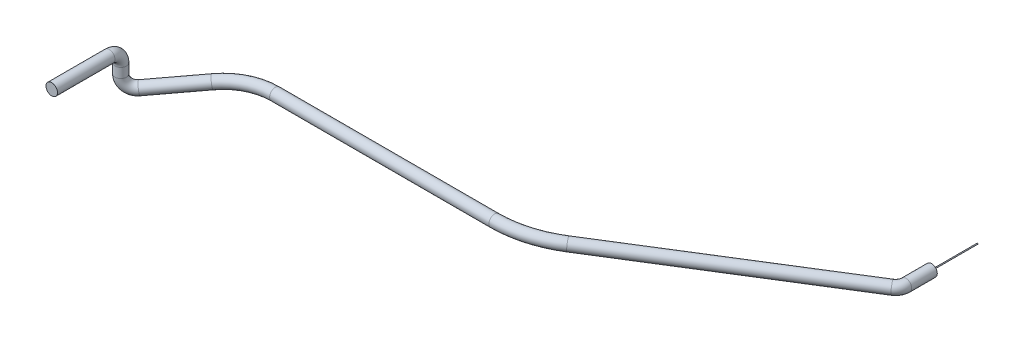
from build123d import *

# Parameters (mm, degrees)
SKETCH1_R           = 1.5875
SKETCH2_R           = 0.127
BOSS_EXTRUDE1_DEPTH = 12.7


with BuildPart() as part:
    # Base-Sweep: sweep along a curve in space
    with BuildLine() as base_sweep_path:
        Line((60.579, -0.5715, 0), (60.579, -0.5715, 7.057497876))
        ThreePointArc((59.296956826, -0.477858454, 9.609018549), (60.24038432, -0.546767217, 8.486016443), (60.579, -0.5715, 7.057497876))
        Line((59.296956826, -0.477858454, 9.609018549), (7.925667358, 3.274345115, 47.753631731))
        ThreePointArc((-7.263623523, 3.767940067, 52.771480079), (0.738516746, 3.641317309, 51.484242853), (7.925667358, 3.274345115, 47.753631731))
        Line((-7.263623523, 3.767940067, 52.771480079), (-67.803491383, 3.767940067, 52.771480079))
        ThreePointArc((-80.473158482, 2.691975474, 57.473848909), (-74.581957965, 3.489848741, 53.986843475), (-67.803491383, 3.767940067, 52.771480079))
        Line((-80.473158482, 2.691975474, 57.473848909), (-91.271591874, 0.546912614, 66.848578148))
        ThreePointArc((-94.024797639, 3.686783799, 69.238791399), (-93.191782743, 1.280954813, 68.515604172), (-91.271591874, 0.546912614, 66.848578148))
        Line((-94.024797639, 3.686783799, 69.238791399), (-94.024797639, 6.35, 69.238791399))
        ThreePointArc((-94.024797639, 9.525, 72.413791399), (-94.024797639, 8.59506403, 70.168727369), (-94.024797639, 6.35, 69.238791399))
        Line((-94.024797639, 9.525, 72.413791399), (-94.024797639, 9.525, 88.288791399))
    # Sketch1 → Base-Sweep (sweep)
    with BuildSketch(Plane.XY):
        with Locations((60.579, -0.5715)):
            Circle(SKETCH1_R)
    sweep(path=base_sweep_path.line)

    # Sketch2 → Boss-Extrude1 (add)
    with BuildSketch(Plane(origin=(0, 0, 0), x_dir=(-1, 0, 0), z_dir=(0, 0, -1))):
        with Locations(Location((-60.579, -0.5715, 0), (0, 0, 180))):
            Circle(SKETCH2_R)
    extrude(amount=BOSS_EXTRUDE1_DEPTH)


solid = part.part
